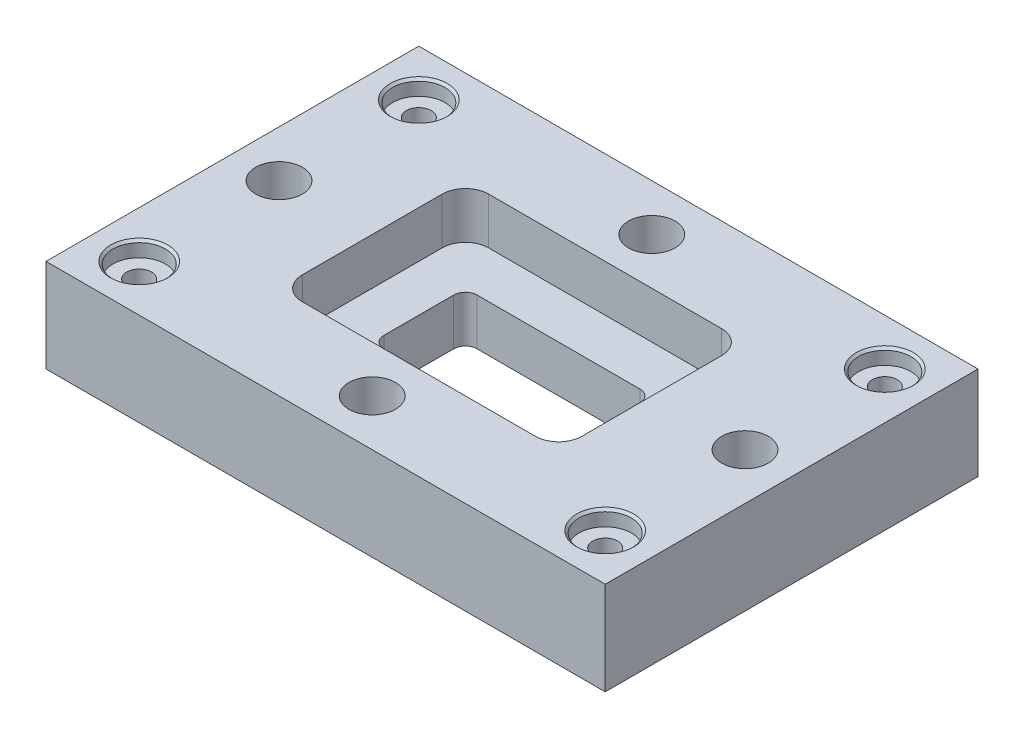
from build123d import *

# Parameters (mm, degrees)
SKETCH1_W                                    = 152.4
SKETCH1_H                                    = 101.6
SKETCH1_R                                    = 6.35
BOSS_EXTRUDE1_DEPTH                          = 25.4
CBORE_FOR_1_4_BINDING_HEAD_MACHINE_S_2_COUNT = 2
CBORE_FOR_1_4_BINDING_HEAD_MACHINE_S_2_PITCH = 127
CBORE_FOR_1_4_BINDING_HEAD_MACHINE_S_3_COUNT = 2
CBORE_FOR_1_4_BINDING_HEAD_MACHINE_S_3_PITCH = 148.106178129
CBORE_FOR_1_4_BINDING_HEAD_MACHINE_S_4_COUNT = 2
CBORE_FOR_1_4_BINDING_HEAD_MACHINE_S_4_PITCH = 76.2
SKETCH4_W                                    = 76.2
SKETCH4_H                                    = 50.8
CUT_EXTRUDE1_DEPTH                           = 12.7
FILLET1_R                                    = 6.35
CUT_EXTRUDE2_DEPTH                           = 93.457395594


with BuildPart() as part:
    # Sketch1 → Boss-Extrude1 (new body)
    with BuildSketch(Plane(origin=(0, 0, 0), x_dir=(1, 0, 0), z_dir=(0, 1, 0))):
        Rectangle(SKETCH1_W, SKETCH1_H)
        with Locations(Location((-63.5, 0, 0), (0, 0, 270))):
            Circle(SKETCH1_R, mode=Mode.SUBTRACT)
        with Locations(Location((63.5, 0, 0), (0, 0, 270))):
            Circle(SKETCH1_R, mode=Mode.SUBTRACT)
        with Locations(Location((0, -38.1, 0), (0, 0, 270))):
            Circle(SKETCH1_R, mode=Mode.SUBTRACT)
        with Locations(Location((0, 38.1, 0), (0, 0, 270))):
            Circle(SKETCH1_R, mode=Mode.SUBTRACT)
    extrude(amount=BOSS_EXTRUDE1_DEPTH)

    # Sketch3 → CBORE for 1_4 Binding Head Machine Screw (revolve, cut)
    with BuildSketch(Plane(origin=(-63.5, 25.4, -38.1), x_dir=(0, 0, 1), z_dir=(1, 0, 0))):
        Polygon((0, 0), (0, 25.4), (3.3782, 25.4), (3.3782, 4.191), (7.14375, 4.191), (7.14375, 0.635), (7.77875, 0), align=None)
    cbore_for_1_4_binding_head_machine_screw = revolve(axis=Axis((-63.5, 31.75, -38.1), (0, -1, 0)), mode=Mode.SUBTRACT)

    # CBORE for 1_4 Binding Head Machine S 2: CBORE for 1_4 Binding Head Machine Screw ×2
    with Locations(*[(i * CBORE_FOR_1_4_BINDING_HEAD_MACHINE_S_2_PITCH, 0, 0) for i in range(1, CBORE_FOR_1_4_BINDING_HEAD_MACHINE_S_2_COUNT)]):
        add(cbore_for_1_4_binding_head_machine_screw, mode=Mode.SUBTRACT)

    # CBORE for 1_4 Binding Head Machine S 3: CBORE for 1_4 Binding Head Machine Screw ×2
    with Locations(*[Vector(0.8574929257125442, 0, 0.5144957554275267) * (i * CBORE_FOR_1_4_BINDING_HEAD_MACHINE_S_3_PITCH) for i in range(1, CBORE_FOR_1_4_BINDING_HEAD_MACHINE_S_3_COUNT)]):
        add(cbore_for_1_4_binding_head_machine_screw, mode=Mode.SUBTRACT)

    # CBORE for 1_4 Binding Head Machine S 4: CBORE for 1_4 Binding Head Machine Screw ×2
    with Locations(*[(0, 0, i * CBORE_FOR_1_4_BINDING_HEAD_MACHINE_S_4_PITCH) for i in range(1, CBORE_FOR_1_4_BINDING_HEAD_MACHINE_S_4_COUNT)]):
        add(cbore_for_1_4_binding_head_machine_screw, mode=Mode.SUBTRACT)

    # Sketch4 → Cut-Extrude1 (cut)
    with BuildSketch(Plane(origin=(0, 25.4, 0), x_dir=(1, 0, 0), z_dir=(0, 1, 0))):
        Rectangle(SKETCH4_W, SKETCH4_H)
    extrude(amount=-CUT_EXTRUDE1_DEPTH, mode=Mode.SUBTRACT)

    # Fillet1
    fillet1_edges = [part.edges().sort_by_distance(p)[0] for p in [
        (38.1, 19.05, -25.4),
        (38.1, 19.05, 25.4),
        (-38.1, 19.05, 25.4),
        (-38.1, 19.05, -25.4),
    ]]
    fillet(fillet1_edges, radius=FILLET1_R)

    # Sketch5 → Cut-Extrude2 (cut, through all)
    with BuildSketch(Plane(origin=(0, 12.7, 0), x_dir=(1, 0, 0), z_dir=(0, 1, 0))):
        with BuildLine():
            Line((-22.225, -12.7), (22.225, -12.7))
            ThreePointArc((22.225, -12.7), (24.47006403, -11.77006403), (25.4, -9.525))
            Line((25.4, -9.525), (25.4, 9.525))
            ThreePointArc((25.4, 9.525), (24.47006403, 11.77006403), (22.225, 12.7))
            Line((22.225, 12.7), (-22.225, 12.7))
            ThreePointArc((-22.225, 12.7), (-24.47006403, 11.77006403), (-25.4, 9.525))
            Line((-25.4, 9.525), (-25.4, -9.525))
            ThreePointArc((-25.4, -9.525), (-24.47006403, -11.77006403), (-22.225, -12.7))
        make_face()
    extrude(amount=-CUT_EXTRUDE2_DEPTH, mode=Mode.SUBTRACT)


solid = part.part
